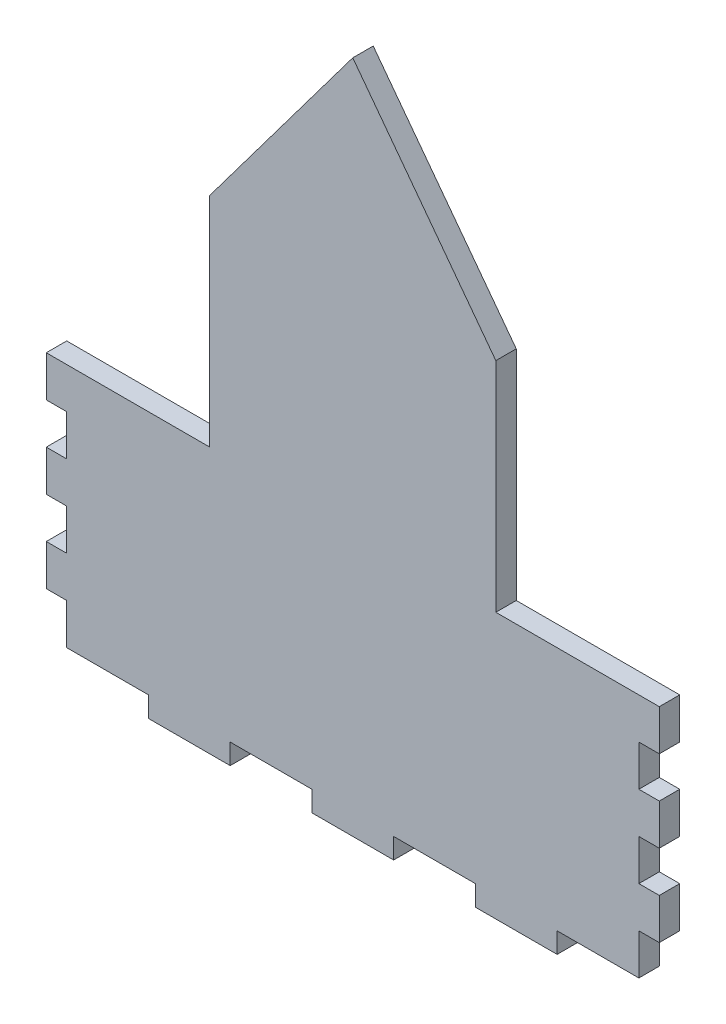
from build123d import *

# Parameters (mm, degrees)
BOSS_EXTRUDE1_DEPTH = 12.7
SKETCH2_W           = 12.7
SKETCH2_H           = 25.4
BOSS_EXTRUDE2_DEPTH = 12.7
SKETCH3_W           = 50.8
SKETCH3_H           = 12.7
BOSS_EXTRUDE3_DEPTH = 12.7


with BuildPart() as part:
    # Sketch1 → Boss-Extrude1 (new body)
    with BuildSketch(Plane.XY):
        Polygon((266.7, 152.4), (355.6, 152.4), (355.6, 0), (0, 0), (0, 152.4), (88.9, 152.4), (88.9, 287.8582), (177.8, 406.4), (266.7, 287.8582), align=None)
    extrude(amount=BOSS_EXTRUDE1_DEPTH)

    # Sketch2 → Boss-Extrude2 (add)
    with BuildSketch(Plane.XY.offset(12.7)):
        with Locations((-6.35, 139.7)):
            Rectangle(SKETCH2_W, SKETCH2_H)
        with Locations((-6.35, 88.9)):
            Rectangle(SKETCH2_W, SKETCH2_H)
        with Locations((-6.35, 38.1)):
            Rectangle(SKETCH2_W, SKETCH2_H)
        with Locations((361.95, 139.7)):
            Rectangle(SKETCH2_W, SKETCH2_H)
        with Locations((361.95, 88.9)):
            Rectangle(SKETCH2_W, SKETCH2_H)
        with Locations((361.95, 38.1)):
            Rectangle(SKETCH2_W, SKETCH2_H)
    extrude(amount=-BOSS_EXTRUDE2_DEPTH)

    # Sketch3 → Boss-Extrude3 (add)
    with BuildSketch(Plane.XZ):
        with Locations((76.2, 6.35)):
            Rectangle(SKETCH3_W, SKETCH3_H)
        with Locations((177.8, 6.35)):
            Rectangle(SKETCH3_W, SKETCH3_H)
        with Locations((279.4, 6.35)):
            Rectangle(SKETCH3_W, SKETCH3_H)
    extrude(amount=BOSS_EXTRUDE3_DEPTH)


solid = part.part
